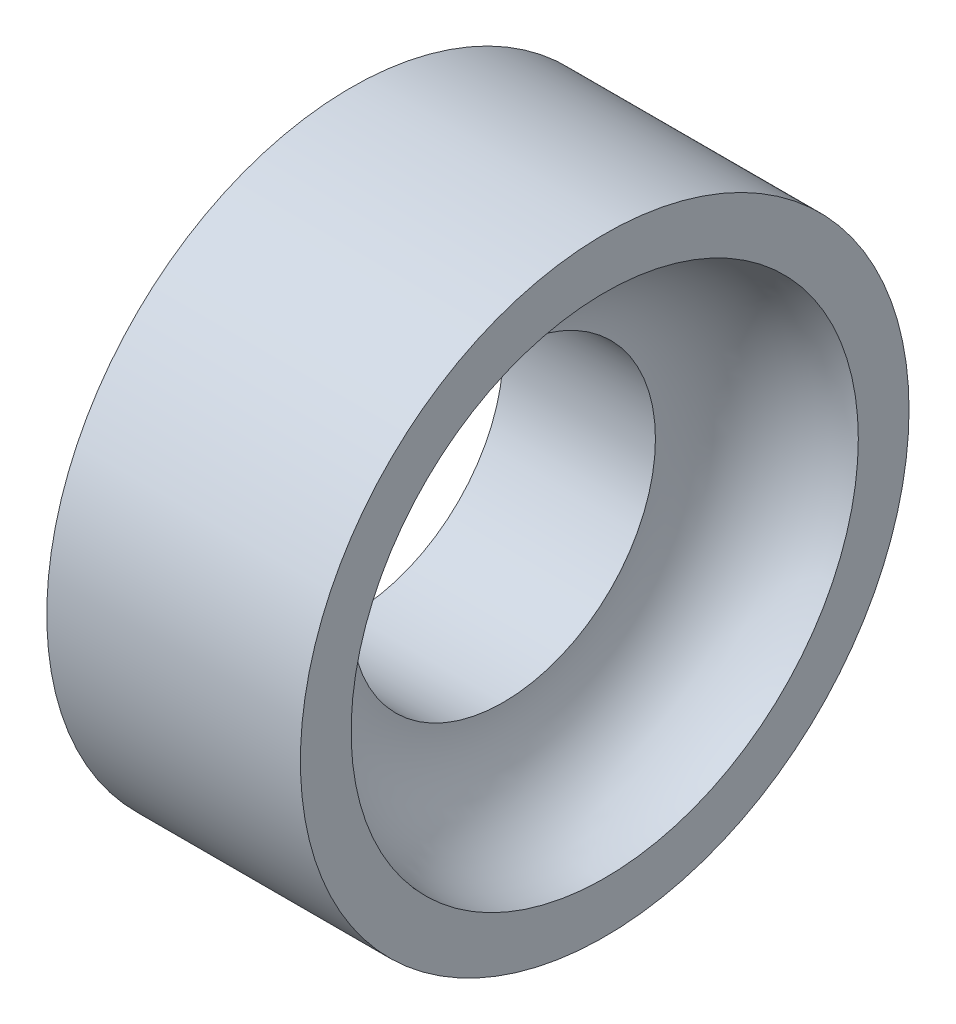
from build123d import *

# Parameters (mm, degrees)
ESQUISSE1_W             = 5
ESQUISSE1_H             = 6
ESQUISSE2_R             = 3
ENL_V_MAT_EXTRU_1_DEPTH = 6


with BuildPart() as part:
    # Esquisse1 → Base-R_volution (revolve)
    with BuildSketch(Plane.XY, mode=Mode.PRIVATE) as base_r_volution_sk:
        with Locations((-2.5, -3)):
            Rectangle(ESQUISSE1_W, ESQUISSE1_H)
    revolve(base_r_volution_sk.sketch.rotate(Axis((0, 0, 0), (-1, 0, 0)), 270), axis=Axis((0, 0, 0), (-1, 0, 0)))

    # Esquisse2 → Enl_v. mat.-Extru.1 (cut)
    with BuildSketch(Plane(origin=(0, 0, 0), x_dir=(0, 0, -1), z_dir=(1, 0, 0))):
        Circle(ESQUISSE2_R)
    extrude(amount=-ENL_V_MAT_EXTRU_1_DEPTH, mode=Mode.SUBTRACT)

    # Esquisse3 → Enl_vement de mati_re-R_volution1 (revolve, cut)
    with BuildSketch(Plane.XY, mode=Mode.PRIVATE) as enl_vement_de_mati_re_r_volution1_sk:
        with BuildLine():
            Line((-2, 3), (0, 5))
            ThreePointArc((0, 5), (-1.414213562, 4.414213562), (-2, 3))
        make_face()
    revolve(enl_vement_de_mati_re_r_volution1_sk.sketch.rotate(Axis((0, 0, 0), (-1, 0, 0)), 90), axis=Axis((0, 0, 0), (-1, 0, 0)), mode=Mode.SUBTRACT)


with BuildPart() as enl_vement_de_mati_re_r_volution1_kept_p:
    # of the separate pieces the step leaves, the one the design keeps (enl_vement_de_mati_re_r_volution1_pieces)
    add(part.part.solids().sort_by_distance((0, 0, -6))[0])


solid = enl_vement_de_mati_re_r_volution1_kept_p.part
